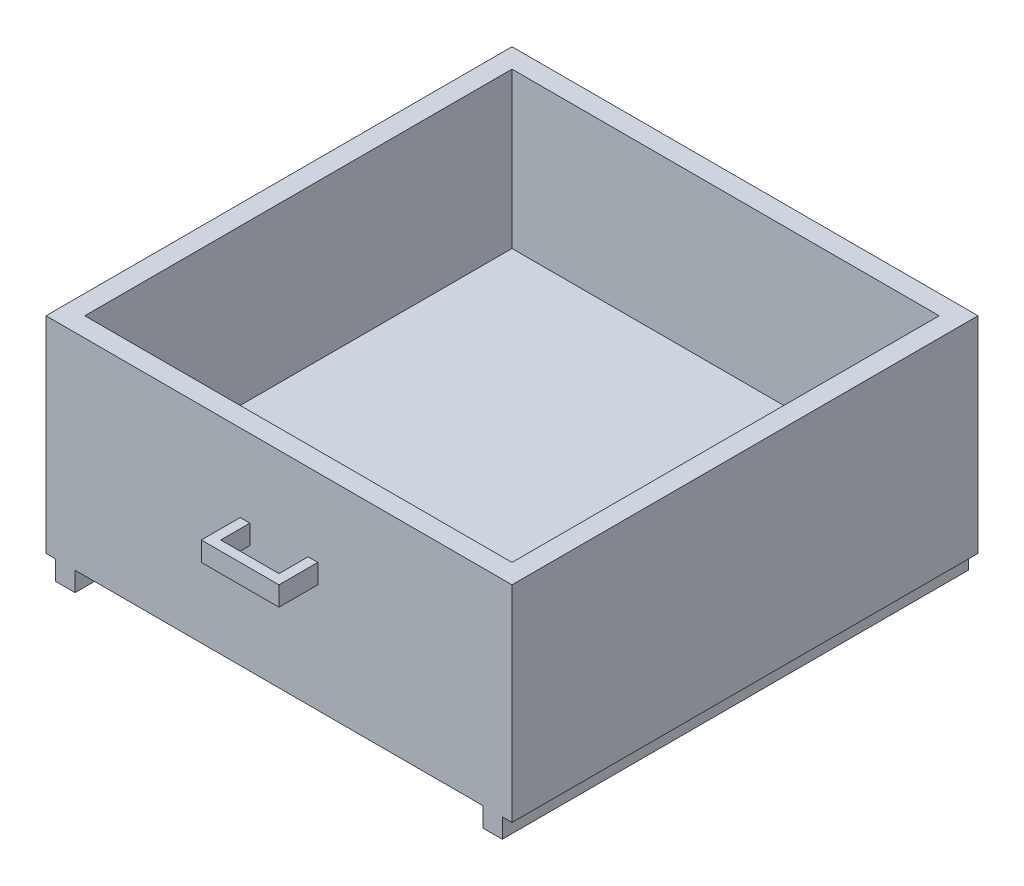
ISO-10303-21;
HEADER;
FILE_DESCRIPTION(('STEP AP214'),'2;1');
FILE_NAME('part.step','',(''),(''),'','','');
FILE_SCHEMA(('AUTOMOTIVE_DESIGN { 1 0 10303 214 1 1 1 1 }'));
ENDSEC;
DATA;
#1=APPLICATION_CONTEXT('core data for automotive mechanical design processes');
#2=APPLICATION_PROTOCOL_DEFINITION('international standard','automotive_design',2000,#1);
#3=PRODUCT_CONTEXT('',#1,'mechanical');
#4=PRODUCT('Part','Part','',(#3));
#5=PRODUCT_RELATED_PRODUCT_CATEGORY('part','',(#4));
#6=PRODUCT_DEFINITION_FORMATION('','',#4);
#7=PRODUCT_DEFINITION_CONTEXT('part definition',#1,'design');
#8=PRODUCT_DEFINITION('design','',#6,#7);
#9=PRODUCT_DEFINITION_SHAPE('','',#8);
#10=(LENGTH_UNIT() NAMED_UNIT(*) SI_UNIT(.MILLI.,.METRE.));
#11=(NAMED_UNIT(*) PLANE_ANGLE_UNIT() SI_UNIT($,.RADIAN.));
#12=(NAMED_UNIT(*) SI_UNIT($,.STERADIAN.) SOLID_ANGLE_UNIT());
#13=UNCERTAINTY_MEASURE_WITH_UNIT(LENGTH_MEASURE(1.E-05),#10,'distance_accuracy_value','');
#14=(GEOMETRIC_REPRESENTATION_CONTEXT(3) GLOBAL_UNCERTAINTY_ASSIGNED_CONTEXT((#13)) GLOBAL_UNIT_ASSIGNED_CONTEXT((#10,
#11,#12)) REPRESENTATION_CONTEXT('',''));
#15=CARTESIAN_POINT('',(0.,0.,0.));
#16=DIRECTION('',(0.,0.,1.));
#17=DIRECTION('',(1.,0.,0.));
#18=AXIS2_PLACEMENT_3D('',#15,#16,#17);
#19=CARTESIAN_POINT('',(-152.4,134.62,152.4));
#20=DIRECTION('',(1.,0.,0.));
#21=DIRECTION('',(0.,1.,0.));
#22=AXIS2_PLACEMENT_3D('',#19,#20,#21);
#23=PLANE('',#22);
#24=DIRECTION('',(0.,-1.,0.));
#25=VECTOR('',#24,1.);
#26=CARTESIAN_POINT('',(-152.4,134.62,-152.4));
#27=LINE('',#26,#25);
#28=CARTESIAN_POINT('',(-152.4,134.62,-152.4));
#29=VERTEX_POINT('',#28);
#30=CARTESIAN_POINT('',(-152.4,0.,-152.4));
#31=VERTEX_POINT('',#30);
#32=EDGE_CURVE('E282',#29,#31,#27,.T.);
#33=ORIENTED_EDGE('',*,*,#32,.T.);
#34=DIRECTION('',(0.,0.,-1.));
#35=VECTOR('',#34,1.);
#36=CARTESIAN_POINT('',(-152.4,0.,152.4));
#37=LINE('',#36,#35);
#38=CARTESIAN_POINT('',(-152.4,0.,152.4));
#39=VERTEX_POINT('',#38);
#40=EDGE_CURVE('E377',#39,#31,#37,.T.);
#41=ORIENTED_EDGE('',*,*,#40,.F.);
#42=DIRECTION('',(0.,-1.,0.));
#43=VECTOR('',#42,1.);
#44=CARTESIAN_POINT('',(-152.4,134.62,152.4));
#45=LINE('',#44,#43);
#46=CARTESIAN_POINT('',(-152.4,134.62,152.4));
#47=VERTEX_POINT('',#46);
#48=EDGE_CURVE('E289',#47,#39,#45,.T.);
#49=ORIENTED_EDGE('',*,*,#48,.F.);
#50=DIRECTION('',(0.,0.,-1.));
#51=VECTOR('',#50,1.);
#52=CARTESIAN_POINT('',(-152.4,134.62,152.4));
#53=LINE('',#52,#51);
#54=EDGE_CURVE('E321',#47,#29,#53,.T.);
#55=ORIENTED_EDGE('',*,*,#54,.T.);
#56=EDGE_LOOP('',(#33,#41,#49,#55));
#57=FACE_BOUND('',#56,.T.);
#58=ADVANCED_FACE('F39',(#57),#23,.F.);
#59=CARTESIAN_POINT('',(-152.4,0.,152.4));
#60=DIRECTION('',(0.,1.,0.));
#61=DIRECTION('',(-1.,0.,0.));
#62=AXIS2_PLACEMENT_3D('',#59,#60,#61);
#63=PLANE('',#62);
#64=DIRECTION('',(1.,0.,0.));
#65=VECTOR('',#64,1.);
#66=CARTESIAN_POINT('',(-152.4,0.,-152.4));
#67=LINE('',#66,#65);
#68=CARTESIAN_POINT('',(-146.05,0.,-152.4));
#69=VERTEX_POINT('',#68);
#70=EDGE_CURVE('E324',#31,#69,#67,.T.);
#71=ORIENTED_EDGE('',*,*,#70,.T.);
#72=DIRECTION('',(0.,0.,-1.));
#73=VECTOR('',#72,1.);
#74=CARTESIAN_POINT('',(-146.05,0.,152.4));
#75=LINE('',#74,#73);
#76=CARTESIAN_POINT('',(-146.05,0.,152.4));
#77=VERTEX_POINT('',#76);
#78=EDGE_CURVE('E374',#77,#69,#75,.T.);
#79=ORIENTED_EDGE('',*,*,#78,.F.);
#80=DIRECTION('',(1.,0.,0.));
#81=VECTOR('',#80,1.);
#82=CARTESIAN_POINT('',(-152.4,0.,152.4));
#83=LINE('',#82,#81);
#84=EDGE_CURVE('E292',#39,#77,#83,.T.);
#85=ORIENTED_EDGE('',*,*,#84,.F.);
#86=ORIENTED_EDGE('',*,*,#40,.T.);
#87=EDGE_LOOP('',(#71,#79,#85,#86));
#88=FACE_BOUND('',#87,.T.);
#89=ADVANCED_FACE('F421',(#88),#63,.F.);
#90=CARTESIAN_POINT('',(-146.05,0.,152.4));
#91=DIRECTION('',(1.,0.,0.));
#92=DIRECTION('',(0.,0.,-1.));
#93=AXIS2_PLACEMENT_3D('',#90,#91,#92);
#94=PLANE('',#93);
#95=DIRECTION('',(0.,-1.,0.));
#96=VECTOR('',#95,1.);
#97=CARTESIAN_POINT('',(-146.05,0.,-152.4));
#98=LINE('',#97,#96);
#99=CARTESIAN_POINT('',(-146.05,-12.7000000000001,-152.4));
#100=VERTEX_POINT('',#99);
#101=EDGE_CURVE('E326',#69,#100,#98,.T.);
#102=ORIENTED_EDGE('',*,*,#101,.T.);
#103=DIRECTION('',(0.,0.,-1.));
#104=VECTOR('',#103,1.);
#105=CARTESIAN_POINT('',(-146.05,-12.7000000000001,152.4));
#106=LINE('',#105,#104);
#107=CARTESIAN_POINT('',(-146.05,-12.7000000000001,152.4));
#108=VERTEX_POINT('',#107);
#109=EDGE_CURVE('E371',#108,#100,#106,.T.);
#110=ORIENTED_EDGE('',*,*,#109,.F.);
#111=DIRECTION('',(0.,-1.,0.));
#112=VECTOR('',#111,1.);
#113=CARTESIAN_POINT('',(-146.05,0.,152.4));
#114=LINE('',#113,#112);
#115=EDGE_CURVE('E295',#77,#108,#114,.T.);
#116=ORIENTED_EDGE('',*,*,#115,.F.);
#117=ORIENTED_EDGE('',*,*,#78,.T.);
#118=EDGE_LOOP('',(#102,#110,#116,#117));
#119=FACE_BOUND('',#118,.T.);
#120=ADVANCED_FACE('F426',(#119),#94,.F.);
#121=CARTESIAN_POINT('',(-146.05,-12.7000000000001,152.4));
#122=DIRECTION('',(0.,1.,0.));
#123=DIRECTION('',(-1.,0.,0.));
#124=AXIS2_PLACEMENT_3D('',#121,#122,#123);
#125=PLANE('',#124);
#126=DIRECTION('',(1.,0.,0.));
#127=VECTOR('',#126,1.);
#128=CARTESIAN_POINT('',(-146.05,-12.7000000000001,-152.4));
#129=LINE('',#128,#127);
#130=CARTESIAN_POINT('',(-133.35,-12.7000000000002,-152.4));
#131=VERTEX_POINT('',#130);
#132=EDGE_CURVE('E328',#100,#131,#129,.T.);
#133=ORIENTED_EDGE('',*,*,#132,.T.);
#134=DIRECTION('',(0.,0.,-1.));
#135=VECTOR('',#134,1.);
#136=CARTESIAN_POINT('',(-133.35,-12.7000000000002,152.4));
#137=LINE('',#136,#135);
#138=CARTESIAN_POINT('',(-133.35,-12.7000000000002,152.4));
#139=VERTEX_POINT('',#138);
#140=EDGE_CURVE('E368',#139,#131,#137,.T.);
#141=ORIENTED_EDGE('',*,*,#140,.F.);
#142=DIRECTION('',(1.,0.,0.));
#143=VECTOR('',#142,1.);
#144=CARTESIAN_POINT('',(-146.05,-12.7000000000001,152.4));
#145=LINE('',#144,#143);
#146=EDGE_CURVE('E297',#108,#139,#145,.T.);
#147=ORIENTED_EDGE('',*,*,#146,.F.);
#148=ORIENTED_EDGE('',*,*,#109,.T.);
#149=EDGE_LOOP('',(#133,#141,#147,#148));
#150=FACE_BOUND('',#149,.T.);
#151=ADVANCED_FACE('F467',(#150),#125,.F.);
#152=CARTESIAN_POINT('',(-133.35,-12.7000000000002,152.4));
#153=DIRECTION('',(-1.,0.,0.));
#154=DIRECTION('',(0.,0.,1.));
#155=AXIS2_PLACEMENT_3D('',#152,#153,#154);
#156=PLANE('',#155);
#157=DIRECTION('',(0.,1.,0.));
#158=VECTOR('',#157,1.);
#159=CARTESIAN_POINT('',(-133.35,-12.7000000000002,-152.4));
#160=LINE('',#159,#158);
#161=CARTESIAN_POINT('',(-133.35,0.,-152.4));
#162=VERTEX_POINT('',#161);
#163=EDGE_CURVE('E330',#131,#162,#160,.T.);
#164=ORIENTED_EDGE('',*,*,#163,.T.);
#165=DIRECTION('',(0.,0.,-1.));
#166=VECTOR('',#165,1.);
#167=CARTESIAN_POINT('',(-133.35,0.,152.4));
#168=LINE('',#167,#166);
#169=CARTESIAN_POINT('',(-133.35,0.,152.4));
#170=VERTEX_POINT('',#169);
#171=EDGE_CURVE('E365',#170,#162,#168,.T.);
#172=ORIENTED_EDGE('',*,*,#171,.F.);
#173=DIRECTION('',(0.,1.,0.));
#174=VECTOR('',#173,1.);
#175=CARTESIAN_POINT('',(-133.35,-12.7000000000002,152.4));
#176=LINE('',#175,#174);
#177=EDGE_CURVE('E299',#139,#170,#176,.T.);
#178=ORIENTED_EDGE('',*,*,#177,.F.);
#179=ORIENTED_EDGE('',*,*,#140,.T.);
#180=EDGE_LOOP('',(#164,#172,#178,#179));
#181=FACE_BOUND('',#180,.T.);
#182=ADVANCED_FACE('F463',(#181),#156,.F.);
#183=CARTESIAN_POINT('',(-133.35,0.,152.4));
#184=DIRECTION('',(0.,1.,0.));
#185=DIRECTION('',(-1.,0.,0.));
#186=AXIS2_PLACEMENT_3D('',#183,#184,#185);
#187=PLANE('',#186);
#188=DIRECTION('',(1.,0.,0.));
#189=VECTOR('',#188,1.);
#190=CARTESIAN_POINT('',(-133.35,0.,-152.4));
#191=LINE('',#190,#189);
#192=CARTESIAN_POINT('',(133.35,1.31838984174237E-13,-152.4));
#193=VERTEX_POINT('',#192);
#194=EDGE_CURVE('E332',#162,#193,#191,.T.);
#195=ORIENTED_EDGE('',*,*,#194,.T.);
#196=DIRECTION('',(0.,0.,-1.));
#197=VECTOR('',#196,1.);
#198=CARTESIAN_POINT('',(133.35,1.31838984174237E-13,152.4));
#199=LINE('',#198,#197);
#200=CARTESIAN_POINT('',(133.35,1.31838984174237E-13,152.4));
#201=VERTEX_POINT('',#200);
#202=EDGE_CURVE('E363',#201,#193,#199,.T.);
#203=ORIENTED_EDGE('',*,*,#202,.F.);
#204=DIRECTION('',(1.,0.,0.));
#205=VECTOR('',#204,1.);
#206=CARTESIAN_POINT('',(-133.35,0.,152.4));
#207=LINE('',#206,#205);
#208=EDGE_CURVE('E301',#170,#201,#207,.T.);
#209=ORIENTED_EDGE('',*,*,#208,.F.);
#210=ORIENTED_EDGE('',*,*,#171,.T.);
#211=EDGE_LOOP('',(#195,#203,#209,#210));
#212=FACE_BOUND('',#211,.T.);
#213=ADVANCED_FACE('F459',(#212),#187,.F.);
#214=CARTESIAN_POINT('',(133.35,-12.7000000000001,152.4));
#215=DIRECTION('',(-1.,0.,0.));
#216=DIRECTION('',(0.,0.,1.));
#217=AXIS2_PLACEMENT_3D('',#214,#215,#216);
#218=PLANE('',#217);
#219=DIRECTION('',(0.,1.,0.));
#220=VECTOR('',#219,1.);
#221=CARTESIAN_POINT('',(133.35,-12.7000000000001,-152.4));
#222=LINE('',#221,#220);
#223=CARTESIAN_POINT('',(133.35,-12.7000000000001,-152.4));
#224=VERTEX_POINT('',#223);
#225=EDGE_CURVE('E335',#224,#193,#222,.T.);
#226=ORIENTED_EDGE('',*,*,#225,.F.);
#227=DIRECTION('',(0.,0.,-1.));
#228=VECTOR('',#227,1.);
#229=CARTESIAN_POINT('',(133.35,-12.7000000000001,152.4));
#230=LINE('',#229,#228);
#231=CARTESIAN_POINT('',(133.35,-12.7000000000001,152.4));
#232=VERTEX_POINT('',#231);
#233=EDGE_CURVE('E361',#232,#224,#230,.T.);
#234=ORIENTED_EDGE('',*,*,#233,.F.);
#235=DIRECTION('',(0.,1.,0.));
#236=VECTOR('',#235,1.);
#237=CARTESIAN_POINT('',(133.35,-12.7000000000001,152.4));
#238=LINE('',#237,#236);
#239=EDGE_CURVE('E303',#232,#201,#238,.T.);
#240=ORIENTED_EDGE('',*,*,#239,.T.);
#241=ORIENTED_EDGE('',*,*,#202,.T.);
#242=EDGE_LOOP('',(#226,#234,#240,#241));
#243=FACE_BOUND('',#242,.T.);
#244=ADVANCED_FACE('F454',(#243),#218,.T.);
#245=CARTESIAN_POINT('',(146.05,-12.7,152.4));
#246=DIRECTION('',(0.,-1.,0.));
#247=DIRECTION('',(1.,0.,0.));
#248=AXIS2_PLACEMENT_3D('',#245,#246,#247);
#249=PLANE('',#248);
#250=DIRECTION('',(-1.,0.,0.));
#251=VECTOR('',#250,1.);
#252=CARTESIAN_POINT('',(146.05,-12.7,-152.4));
#253=LINE('',#252,#251);
#254=CARTESIAN_POINT('',(146.05,-12.7,-152.4));
#255=VERTEX_POINT('',#254);
#256=EDGE_CURVE('E338',#255,#224,#253,.T.);
#257=ORIENTED_EDGE('',*,*,#256,.F.);
#258=DIRECTION('',(0.,0.,-1.));
#259=VECTOR('',#258,1.);
#260=CARTESIAN_POINT('',(146.05,-12.7,152.4));
#261=LINE('',#260,#259);
#262=CARTESIAN_POINT('',(146.05,-12.7,152.4));
#263=VERTEX_POINT('',#262);
#264=EDGE_CURVE('E359',#263,#255,#261,.T.);
#265=ORIENTED_EDGE('',*,*,#264,.F.);
#266=DIRECTION('',(-1.,0.,0.));
#267=VECTOR('',#266,1.);
#268=CARTESIAN_POINT('',(146.05,-12.7,152.4));
#269=LINE('',#268,#267);
#270=EDGE_CURVE('E306',#263,#232,#269,.T.);
#271=ORIENTED_EDGE('',*,*,#270,.T.);
#272=ORIENTED_EDGE('',*,*,#233,.T.);
#273=EDGE_LOOP('',(#257,#265,#271,#272));
#274=FACE_BOUND('',#273,.T.);
#275=ADVANCED_FACE('F449',(#274),#249,.T.);
#276=CARTESIAN_POINT('',(146.05,0.,152.4));
#277=DIRECTION('',(1.,0.,0.));
#278=DIRECTION('',(0.,0.,-1.));
#279=AXIS2_PLACEMENT_3D('',#276,#277,#278);
#280=PLANE('',#279);
#281=DIRECTION('',(0.,-1.,0.));
#282=VECTOR('',#281,1.);
#283=CARTESIAN_POINT('',(146.05,0.,-152.4));
#284=LINE('',#283,#282);
#285=CARTESIAN_POINT('',(146.05,0.,-152.4));
#286=VERTEX_POINT('',#285);
#287=EDGE_CURVE('E341',#286,#255,#284,.T.);
#288=ORIENTED_EDGE('',*,*,#287,.F.);
#289=DIRECTION('',(0.,0.,-1.));
#290=VECTOR('',#289,1.);
#291=CARTESIAN_POINT('',(146.05,0.,152.4));
#292=LINE('',#291,#290);
#293=CARTESIAN_POINT('',(146.05,0.,152.4));
#294=VERTEX_POINT('',#293);
#295=EDGE_CURVE('E357',#294,#286,#292,.T.);
#296=ORIENTED_EDGE('',*,*,#295,.F.);
#297=DIRECTION('',(0.,-1.,0.));
#298=VECTOR('',#297,1.);
#299=CARTESIAN_POINT('',(146.05,0.,152.4));
#300=LINE('',#299,#298);
#301=EDGE_CURVE('E309',#294,#263,#300,.T.);
#302=ORIENTED_EDGE('',*,*,#301,.T.);
#303=ORIENTED_EDGE('',*,*,#264,.T.);
#304=EDGE_LOOP('',(#288,#296,#302,#303));
#305=FACE_BOUND('',#304,.T.);
#306=ADVANCED_FACE('F445',(#305),#280,.T.);
#307=CARTESIAN_POINT('',(152.4,0.,152.4));
#308=DIRECTION('',(0.,-1.,0.));
#309=DIRECTION('',(0.,0.,-1.));
#310=AXIS2_PLACEMENT_3D('',#307,#308,#309);
#311=PLANE('',#310);
#312=DIRECTION('',(-1.,0.,0.));
#313=VECTOR('',#312,1.);
#314=CARTESIAN_POINT('',(152.4,0.,-152.4));
#315=LINE('',#314,#313);
#316=CARTESIAN_POINT('',(152.4,0.,-152.4));
#317=VERTEX_POINT('',#316);
#318=EDGE_CURVE('E344',#317,#286,#315,.T.);
#319=ORIENTED_EDGE('',*,*,#318,.F.);
#320=DIRECTION('',(0.,0.,-1.));
#321=VECTOR('',#320,1.);
#322=CARTESIAN_POINT('',(152.4,0.,152.4));
#323=LINE('',#322,#321);
#324=CARTESIAN_POINT('',(152.4,0.,152.4));
#325=VERTEX_POINT('',#324);
#326=EDGE_CURVE('E355',#325,#317,#323,.T.);
#327=ORIENTED_EDGE('',*,*,#326,.F.);
#328=DIRECTION('',(-1.,0.,0.));
#329=VECTOR('',#328,1.);
#330=CARTESIAN_POINT('',(152.4,0.,152.4));
#331=LINE('',#330,#329);
#332=EDGE_CURVE('E312',#325,#294,#331,.T.);
#333=ORIENTED_EDGE('',*,*,#332,.T.);
#334=ORIENTED_EDGE('',*,*,#295,.T.);
#335=EDGE_LOOP('',(#319,#327,#333,#334));
#336=FACE_BOUND('',#335,.T.);
#337=ADVANCED_FACE('F441',(#336),#311,.T.);
#338=CARTESIAN_POINT('',(152.4,134.62,152.4));
#339=DIRECTION('',(1.,0.,0.));
#340=DIRECTION('',(0.,1.,0.));
#341=AXIS2_PLACEMENT_3D('',#338,#339,#340);
#342=PLANE('',#341);
#343=DIRECTION('',(0.,-1.,0.));
#344=VECTOR('',#343,1.);
#345=CARTESIAN_POINT('',(152.4,134.62,-152.4));
#346=LINE('',#345,#344);
#347=CARTESIAN_POINT('',(152.4,134.62,-152.4));
#348=VERTEX_POINT('',#347);
#349=EDGE_CURVE('E347',#348,#317,#346,.T.);
#350=ORIENTED_EDGE('',*,*,#349,.F.);
#351=DIRECTION('',(0.,0.,-1.));
#352=VECTOR('',#351,1.);
#353=CARTESIAN_POINT('',(152.4,134.62,152.4));
#354=LINE('',#353,#352);
#355=CARTESIAN_POINT('',(152.4,134.62,152.4));
#356=VERTEX_POINT('',#355);
#357=EDGE_CURVE('E353',#356,#348,#354,.T.);
#358=ORIENTED_EDGE('',*,*,#357,.F.);
#359=DIRECTION('',(0.,-1.,0.));
#360=VECTOR('',#359,1.);
#361=CARTESIAN_POINT('',(152.4,134.62,152.4));
#362=LINE('',#361,#360);
#363=EDGE_CURVE('E315',#356,#325,#362,.T.);
#364=ORIENTED_EDGE('',*,*,#363,.T.);
#365=ORIENTED_EDGE('',*,*,#326,.T.);
#366=EDGE_LOOP('',(#350,#358,#364,#365));
#367=FACE_BOUND('',#366,.T.);
#368=ADVANCED_FACE('F416',(#367),#342,.T.);
#369=CARTESIAN_POINT('',(-152.4,134.62,152.4));
#370=DIRECTION('',(0.,1.,0.));
#371=DIRECTION('',(-1.,0.,0.));
#372=AXIS2_PLACEMENT_3D('',#369,#370,#371);
#373=PLANE('',#372);
#374=DIRECTION('',(1.,0.,0.));
#375=VECTOR('',#374,1.);
#376=CARTESIAN_POINT('',(139.7,134.62,139.7));
#377=LINE('',#376,#375);
#378=CARTESIAN_POINT('',(-139.7,134.62,139.7));
#379=VERTEX_POINT('',#378);
#380=CARTESIAN_POINT('',(139.7,134.62,139.7));
#381=VERTEX_POINT('',#380);
#382=EDGE_CURVE('E248',#379,#381,#377,.T.);
#383=ORIENTED_EDGE('',*,*,#382,.F.);
#384=DIRECTION('',(0.,0.,1.));
#385=VECTOR('',#384,1.);
#386=CARTESIAN_POINT('',(-139.7,134.62,139.7));
#387=LINE('',#386,#385);
#388=CARTESIAN_POINT('',(-139.7,134.62,-139.7));
#389=VERTEX_POINT('',#388);
#390=EDGE_CURVE('E261',#389,#379,#387,.T.);
#391=ORIENTED_EDGE('',*,*,#390,.F.);
#392=DIRECTION('',(-1.,0.,0.));
#393=VECTOR('',#392,1.);
#394=CARTESIAN_POINT('',(-139.7,134.62,-139.7));
#395=LINE('',#394,#393);
#396=CARTESIAN_POINT('',(139.7,134.62,-139.7));
#397=VERTEX_POINT('',#396);
#398=EDGE_CURVE('E275',#397,#389,#395,.T.);
#399=ORIENTED_EDGE('',*,*,#398,.F.);
#400=DIRECTION('',(0.,0.,-1.));
#401=VECTOR('',#400,1.);
#402=CARTESIAN_POINT('',(139.7,134.62,-139.7));
#403=LINE('',#402,#401);
#404=EDGE_CURVE('E272',#381,#397,#403,.T.);
#405=ORIENTED_EDGE('',*,*,#404,.F.);
#406=EDGE_LOOP('',(#383,#391,#399,#405));
#407=FACE_BOUND('',#406,.T.);
#408=DIRECTION('',(1.,0.,0.));
#409=VECTOR('',#408,1.);
#410=CARTESIAN_POINT('',(-152.4,134.62,-152.4));
#411=LINE('',#410,#409);
#412=EDGE_CURVE('E293',#29,#348,#411,.T.);
#413=ORIENTED_EDGE('',*,*,#412,.F.);
#414=ORIENTED_EDGE('',*,*,#54,.F.);
#415=DIRECTION('',(1.,0.,0.));
#416=VECTOR('',#415,1.);
#417=CARTESIAN_POINT('',(-152.4,134.62,152.4));
#418=LINE('',#417,#416);
#419=EDGE_CURVE('E318',#47,#356,#418,.T.);
#420=ORIENTED_EDGE('',*,*,#419,.T.);
#421=ORIENTED_EDGE('',*,*,#357,.T.);
#422=EDGE_LOOP('',(#413,#414,#420,#421));
#423=FACE_BOUND('',#422,.T.);
#424=ADVANCED_FACE('F406',(#407,#423),#373,.T.);
#425=CARTESIAN_POINT('',(0.,0.,152.4));
#426=DIRECTION('',(0.,0.,1.));
#427=DIRECTION('',(1.,0.,0.));
#428=AXIS2_PLACEMENT_3D('',#425,#426,#427);
#429=PLANE('',#428);
#430=ORIENTED_EDGE('',*,*,#208,.T.);
#431=ORIENTED_EDGE('',*,*,#239,.F.);
#432=ORIENTED_EDGE('',*,*,#270,.F.);
#433=ORIENTED_EDGE('',*,*,#301,.F.);
#434=ORIENTED_EDGE('',*,*,#332,.F.);
#435=ORIENTED_EDGE('',*,*,#363,.F.);
#436=ORIENTED_EDGE('',*,*,#419,.F.);
#437=ORIENTED_EDGE('',*,*,#48,.T.);
#438=ORIENTED_EDGE('',*,*,#84,.T.);
#439=ORIENTED_EDGE('',*,*,#115,.T.);
#440=ORIENTED_EDGE('',*,*,#146,.T.);
#441=ORIENTED_EDGE('',*,*,#177,.T.);
#442=EDGE_LOOP('',(#430,#431,#432,#433,#434,#435,#436,#437,#438,#439,#440,#441));
#443=FACE_BOUND('',#442,.T.);
#444=DIRECTION('',(-1.,0.,0.));
#445=VECTOR('',#444,1.);
#446=CARTESIAN_POINT('',(25.4,71.12,152.4));
#447=LINE('',#446,#445);
#448=CARTESIAN_POINT('',(25.4,71.12,152.4));
#449=VERTEX_POINT('',#448);
#450=CARTESIAN_POINT('',(19.05,71.12,152.4));
#451=VERTEX_POINT('',#450);
#452=EDGE_CURVE('E238',#449,#451,#447,.T.);
#453=ORIENTED_EDGE('',*,*,#452,.T.);
#454=DIRECTION('',(0.,1.,0.));
#455=VECTOR('',#454,1.);
#456=CARTESIAN_POINT('',(19.05,-12.7000000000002,152.4));
#457=LINE('',#456,#455);
#458=CARTESIAN_POINT('',(19.05,83.82,152.4));
#459=VERTEX_POINT('',#458);
#460=EDGE_CURVE('E204',#451,#459,#457,.T.);
#461=ORIENTED_EDGE('',*,*,#460,.T.);
#462=DIRECTION('',(1.,0.,0.));
#463=VECTOR('',#462,1.);
#464=CARTESIAN_POINT('',(-25.4,83.82,152.4));
#465=LINE('',#464,#463);
#466=CARTESIAN_POINT('',(25.4,83.82,152.4));
#467=VERTEX_POINT('',#466);
#468=EDGE_CURVE('E214',#459,#467,#465,.T.);
#469=ORIENTED_EDGE('',*,*,#468,.T.);
#470=DIRECTION('',(0.,-1.,0.));
#471=VECTOR('',#470,1.);
#472=CARTESIAN_POINT('',(25.4,83.82,152.4));
#473=LINE('',#472,#471);
#474=EDGE_CURVE('E221',#467,#449,#473,.T.);
#475=ORIENTED_EDGE('',*,*,#474,.T.);
#476=EDGE_LOOP('',(#453,#461,#469,#475));
#477=FACE_BOUND('',#476,.T.);
#478=DIRECTION('',(0.,1.,0.));
#479=VECTOR('',#478,1.);
#480=CARTESIAN_POINT('',(-19.05,-12.7000000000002,152.4));
#481=LINE('',#480,#479);
#482=CARTESIAN_POINT('',(-19.05,71.12,152.4));
#483=VERTEX_POINT('',#482);
#484=CARTESIAN_POINT('',(-19.05,83.82,152.4));
#485=VERTEX_POINT('',#484);
#486=EDGE_CURVE('E219',#483,#485,#481,.T.);
#487=ORIENTED_EDGE('',*,*,#486,.F.);
#488=CARTESIAN_POINT('',(-25.4,71.12,152.4));
#489=VERTEX_POINT('',#488);
#490=EDGE_CURVE('E237',#483,#489,#447,.T.);
#491=ORIENTED_EDGE('',*,*,#490,.T.);
#492=DIRECTION('',(0.,-1.,0.));
#493=VECTOR('',#492,1.);
#494=CARTESIAN_POINT('',(-25.4,83.82,152.4));
#495=LINE('',#494,#493);
#496=CARTESIAN_POINT('',(-25.4,83.82,152.4));
#497=VERTEX_POINT('',#496);
#498=EDGE_CURVE('E241',#497,#489,#495,.T.);
#499=ORIENTED_EDGE('',*,*,#498,.F.);
#500=EDGE_CURVE('E227',#497,#485,#465,.T.);
#501=ORIENTED_EDGE('',*,*,#500,.T.);
#502=EDGE_LOOP('',(#487,#491,#499,#501));
#503=FACE_BOUND('',#502,.T.);
#504=ADVANCED_FACE('F389',(#443,#477,#503),#429,.T.);
#505=CARTESIAN_POINT('',(0.,0.,-152.4));
#506=DIRECTION('',(0.,0.,1.));
#507=DIRECTION('',(1.,0.,0.));
#508=AXIS2_PLACEMENT_3D('',#505,#506,#507);
#509=PLANE('',#508);
#510=ORIENTED_EDGE('',*,*,#32,.F.);
#511=ORIENTED_EDGE('',*,*,#412,.T.);
#512=ORIENTED_EDGE('',*,*,#349,.T.);
#513=ORIENTED_EDGE('',*,*,#318,.T.);
#514=ORIENTED_EDGE('',*,*,#287,.T.);
#515=ORIENTED_EDGE('',*,*,#256,.T.);
#516=ORIENTED_EDGE('',*,*,#225,.T.);
#517=ORIENTED_EDGE('',*,*,#194,.F.);
#518=ORIENTED_EDGE('',*,*,#163,.F.);
#519=ORIENTED_EDGE('',*,*,#132,.F.);
#520=ORIENTED_EDGE('',*,*,#101,.F.);
#521=ORIENTED_EDGE('',*,*,#70,.F.);
#522=EDGE_LOOP('',(#510,#511,#512,#513,#514,#515,#516,#517,#518,#519,#520,#521));
#523=FACE_BOUND('',#522,.T.);
#524=ADVANCED_FACE('F405',(#523),#509,.F.);
#525=CARTESIAN_POINT('',(139.7,33.02,139.7));
#526=DIRECTION('',(0.,0.,1.));
#527=DIRECTION('',(1.,0.,0.));
#528=AXIS2_PLACEMENT_3D('',#525,#526,#527);
#529=PLANE('',#528);
#530=ORIENTED_EDGE('',*,*,#382,.T.);
#531=DIRECTION('',(0.,1.,0.));
#532=VECTOR('',#531,1.);
#533=CARTESIAN_POINT('',(139.7,33.02,139.7));
#534=LINE('',#533,#532);
#535=CARTESIAN_POINT('',(139.7,33.02,139.7));
#536=VERTEX_POINT('',#535);
#537=EDGE_CURVE('E270',#536,#381,#534,.T.);
#538=ORIENTED_EDGE('',*,*,#537,.F.);
#539=DIRECTION('',(1.,0.,0.));
#540=VECTOR('',#539,1.);
#541=CARTESIAN_POINT('',(139.7,33.02,139.7));
#542=LINE('',#541,#540);
#543=CARTESIAN_POINT('',(-139.7,33.02,139.7));
#544=VERTEX_POINT('',#543);
#545=EDGE_CURVE('E257',#544,#536,#542,.T.);
#546=ORIENTED_EDGE('',*,*,#545,.F.);
#547=DIRECTION('',(0.,1.,0.));
#548=VECTOR('',#547,1.);
#549=CARTESIAN_POINT('',(-139.7,33.02,139.7));
#550=LINE('',#549,#548);
#551=EDGE_CURVE('E280',#544,#379,#550,.T.);
#552=ORIENTED_EDGE('',*,*,#551,.T.);
#553=EDGE_LOOP('',(#530,#538,#546,#552));
#554=FACE_BOUND('',#553,.T.);
#555=ADVANCED_FACE('F413',(#554),#529,.F.);
#556=CARTESIAN_POINT('',(-139.7,33.02,139.7));
#557=DIRECTION('',(-1.,0.,0.));
#558=DIRECTION('',(0.,0.,1.));
#559=AXIS2_PLACEMENT_3D('',#556,#557,#558);
#560=PLANE('',#559);
#561=ORIENTED_EDGE('',*,*,#390,.T.);
#562=ORIENTED_EDGE('',*,*,#551,.F.);
#563=DIRECTION('',(0.,0.,1.));
#564=VECTOR('',#563,1.);
#565=CARTESIAN_POINT('',(-139.7,33.02,139.7));
#566=LINE('',#565,#564);
#567=CARTESIAN_POINT('',(-139.7,33.02,-139.7));
#568=VERTEX_POINT('',#567);
#569=EDGE_CURVE('E267',#568,#544,#566,.T.);
#570=ORIENTED_EDGE('',*,*,#569,.F.);
#571=DIRECTION('',(0.,1.,0.));
#572=VECTOR('',#571,1.);
#573=CARTESIAN_POINT('',(-139.7,33.02,-139.7));
#574=LINE('',#573,#572);
#575=EDGE_CURVE('E283',#568,#389,#574,.T.);
#576=ORIENTED_EDGE('',*,*,#575,.T.);
#577=EDGE_LOOP('',(#561,#562,#570,#576));
#578=FACE_BOUND('',#577,.T.);
#579=ADVANCED_FACE('F523',(#578),#560,.F.);
#580=CARTESIAN_POINT('',(-139.7,33.02,-139.7));
#581=DIRECTION('',(0.,0.,-1.));
#582=DIRECTION('',(-1.,0.,0.));
#583=AXIS2_PLACEMENT_3D('',#580,#581,#582);
#584=PLANE('',#583);
#585=ORIENTED_EDGE('',*,*,#398,.T.);
#586=ORIENTED_EDGE('',*,*,#575,.F.);
#587=DIRECTION('',(-1.,0.,0.));
#588=VECTOR('',#587,1.);
#589=CARTESIAN_POINT('',(-139.7,33.02,-139.7));
#590=LINE('',#589,#588);
#591=CARTESIAN_POINT('',(139.7,33.02,-139.7));
#592=VERTEX_POINT('',#591);
#593=EDGE_CURVE('E264',#592,#568,#590,.T.);
#594=ORIENTED_EDGE('',*,*,#593,.F.);
#595=DIRECTION('',(0.,1.,0.));
#596=VECTOR('',#595,1.);
#597=CARTESIAN_POINT('',(139.7,33.02,-139.7));
#598=LINE('',#597,#596);
#599=EDGE_CURVE('E285',#592,#397,#598,.T.);
#600=ORIENTED_EDGE('',*,*,#599,.T.);
#601=EDGE_LOOP('',(#585,#586,#594,#600));
#602=FACE_BOUND('',#601,.T.);
#603=ADVANCED_FACE('F532',(#602),#584,.F.);
#604=CARTESIAN_POINT('',(139.7,33.02,-139.7));
#605=DIRECTION('',(1.,0.,0.));
#606=DIRECTION('',(0.,0.,-1.));
#607=AXIS2_PLACEMENT_3D('',#604,#605,#606);
#608=PLANE('',#607);
#609=ORIENTED_EDGE('',*,*,#404,.T.);
#610=ORIENTED_EDGE('',*,*,#599,.F.);
#611=DIRECTION('',(0.,0.,-1.));
#612=VECTOR('',#611,1.);
#613=CARTESIAN_POINT('',(139.7,33.02,-139.7));
#614=LINE('',#613,#612);
#615=EDGE_CURVE('E260',#536,#592,#614,.T.);
#616=ORIENTED_EDGE('',*,*,#615,.F.);
#617=ORIENTED_EDGE('',*,*,#537,.T.);
#618=EDGE_LOOP('',(#609,#610,#616,#617));
#619=FACE_BOUND('',#618,.T.);
#620=ADVANCED_FACE('F542',(#619),#608,.F.);
#621=CARTESIAN_POINT('',(0.,33.02,0.));
#622=DIRECTION('',(0.,-1.,0.));
#623=DIRECTION('',(0.,0.,-1.));
#624=AXIS2_PLACEMENT_3D('',#621,#622,#623);
#625=PLANE('',#624);
#626=ORIENTED_EDGE('',*,*,#545,.T.);
#627=ORIENTED_EDGE('',*,*,#615,.T.);
#628=ORIENTED_EDGE('',*,*,#593,.T.);
#629=ORIENTED_EDGE('',*,*,#569,.T.);
#630=EDGE_LOOP('',(#626,#627,#628,#629));
#631=FACE_BOUND('',#630,.T.);
#632=ADVANCED_FACE('F552',(#631),#625,.F.);
#633=CARTESIAN_POINT('',(25.4,83.82,177.8));
#634=DIRECTION('',(1.,0.,0.));
#635=DIRECTION('',(0.,1.,0.));
#636=AXIS2_PLACEMENT_3D('',#633,#634,#635);
#637=PLANE('',#636);
#638=ORIENTED_EDGE('',*,*,#474,.F.);
#639=DIRECTION('',(0.,0.,-1.));
#640=VECTOR('',#639,1.);
#641=CARTESIAN_POINT('',(25.4,83.82,177.8));
#642=LINE('',#641,#640);
#643=CARTESIAN_POINT('',(25.4,83.82,177.8));
#644=VERTEX_POINT('',#643);
#645=EDGE_CURVE('E246',#644,#467,#642,.T.);
#646=ORIENTED_EDGE('',*,*,#645,.F.);
#647=DIRECTION('',(0.,-1.,0.));
#648=VECTOR('',#647,1.);
#649=CARTESIAN_POINT('',(25.4,83.82,177.8));
#650=LINE('',#649,#648);
#651=CARTESIAN_POINT('',(25.4,71.12,177.8));
#652=VERTEX_POINT('',#651);
#653=EDGE_CURVE('E223',#644,#652,#650,.T.);
#654=ORIENTED_EDGE('',*,*,#653,.T.);
#655=DIRECTION('',(0.,0.,-1.));
#656=VECTOR('',#655,1.);
#657=CARTESIAN_POINT('',(25.4,71.12,177.8));
#658=LINE('',#657,#656);
#659=EDGE_CURVE('E235',#652,#449,#658,.T.);
#660=ORIENTED_EDGE('',*,*,#659,.T.);
#661=EDGE_LOOP('',(#638,#646,#654,#660));
#662=FACE_BOUND('',#661,.T.);
#663=ADVANCED_FACE('F401',(#662),#637,.T.);
#664=CARTESIAN_POINT('',(-25.4,83.82,177.8));
#665=DIRECTION('',(0.,1.,0.));
#666=DIRECTION('',(0.,0.,1.));
#667=AXIS2_PLACEMENT_3D('',#664,#665,#666);
#668=PLANE('',#667);
#669=DIRECTION('',(0.,0.,1.));
#670=VECTOR('',#669,1.);
#671=CARTESIAN_POINT('',(-19.05,83.82,171.45));
#672=LINE('',#671,#670);
#673=CARTESIAN_POINT('',(-19.05,83.82,171.45));
#674=VERTEX_POINT('',#673);
#675=EDGE_CURVE('E53',#485,#674,#672,.T.);
#676=ORIENTED_EDGE('',*,*,#675,.F.);
#677=ORIENTED_EDGE('',*,*,#500,.F.);
#678=DIRECTION('',(0.,0.,-1.));
#679=VECTOR('',#678,1.);
#680=CARTESIAN_POINT('',(-25.4,83.82,177.8));
#681=LINE('',#680,#679);
#682=CARTESIAN_POINT('',(-25.4,83.82,177.8));
#683=VERTEX_POINT('',#682);
#684=EDGE_CURVE('E249',#683,#497,#681,.T.);
#685=ORIENTED_EDGE('',*,*,#684,.F.);
#686=DIRECTION('',(1.,0.,0.));
#687=VECTOR('',#686,1.);
#688=CARTESIAN_POINT('',(-25.4,83.82,177.8));
#689=LINE('',#688,#687);
#690=EDGE_CURVE('E232',#683,#644,#689,.T.);
#691=ORIENTED_EDGE('',*,*,#690,.T.);
#692=ORIENTED_EDGE('',*,*,#645,.T.);
#693=ORIENTED_EDGE('',*,*,#468,.F.);
#694=DIRECTION('',(0.,0.,-1.));
#695=VECTOR('',#694,1.);
#696=CARTESIAN_POINT('',(19.05,83.82,171.45));
#697=LINE('',#696,#695);
#698=CARTESIAN_POINT('',(19.05,83.82,171.45));
#699=VERTEX_POINT('',#698);
#700=EDGE_CURVE('E200',#699,#459,#697,.T.);
#701=ORIENTED_EDGE('',*,*,#700,.F.);
#702=DIRECTION('',(1.,0.,0.));
#703=VECTOR('',#702,1.);
#704=CARTESIAN_POINT('',(-19.05,83.82,171.45));
#705=LINE('',#704,#703);
#706=EDGE_CURVE('E208',#674,#699,#705,.T.);
#707=ORIENTED_EDGE('',*,*,#706,.F.);
#708=EDGE_LOOP('',(#676,#677,#685,#691,#692,#693,#701,#707));
#709=FACE_BOUND('',#708,.T.);
#710=ADVANCED_FACE('F212',(#709),#668,.T.);
#711=CARTESIAN_POINT('',(-25.4,83.82,177.8));
#712=DIRECTION('',(1.,0.,0.));
#713=DIRECTION('',(0.,0.,-1.));
#714=AXIS2_PLACEMENT_3D('',#711,#712,#713);
#715=PLANE('',#714);
#716=ORIENTED_EDGE('',*,*,#498,.T.);
#717=DIRECTION('',(0.,0.,-1.));
#718=VECTOR('',#717,1.);
#719=CARTESIAN_POINT('',(-25.4,71.12,177.8));
#720=LINE('',#719,#718);
#721=CARTESIAN_POINT('',(-25.4,71.12,177.8));
#722=VERTEX_POINT('',#721);
#723=EDGE_CURVE('E252',#722,#489,#720,.T.);
#724=ORIENTED_EDGE('',*,*,#723,.F.);
#725=DIRECTION('',(0.,-1.,0.));
#726=VECTOR('',#725,1.);
#727=CARTESIAN_POINT('',(-25.4,83.82,177.8));
#728=LINE('',#727,#726);
#729=EDGE_CURVE('E230',#683,#722,#728,.T.);
#730=ORIENTED_EDGE('',*,*,#729,.F.);
#731=ORIENTED_EDGE('',*,*,#684,.T.);
#732=EDGE_LOOP('',(#716,#724,#730,#731));
#733=FACE_BOUND('',#732,.T.);
#734=ADVANCED_FACE('F394',(#733),#715,.F.);
#735=CARTESIAN_POINT('',(25.4,71.12,177.8));
#736=DIRECTION('',(0.,-1.,0.));
#737=DIRECTION('',(0.,0.,-1.));
#738=AXIS2_PLACEMENT_3D('',#735,#736,#737);
#739=PLANE('',#738);
#740=DIRECTION('',(0.,0.,-1.));
#741=VECTOR('',#740,1.);
#742=CARTESIAN_POINT('',(-19.05,71.12,177.8));
#743=LINE('',#742,#741);
#744=CARTESIAN_POINT('',(-19.05,71.12,171.45));
#745=VERTEX_POINT('',#744);
#746=EDGE_CURVE('E11',#745,#483,#743,.T.);
#747=ORIENTED_EDGE('',*,*,#746,.F.);
#748=DIRECTION('',(-1.,0.,0.));
#749=VECTOR('',#748,1.);
#750=CARTESIAN_POINT('',(25.4,71.12,171.45));
#751=LINE('',#750,#749);
#752=CARTESIAN_POINT('',(19.05,71.12,171.45));
#753=VERTEX_POINT('',#752);
#754=EDGE_CURVE('E380',#753,#745,#751,.T.);
#755=ORIENTED_EDGE('',*,*,#754,.F.);
#756=DIRECTION('',(0.,0.,1.));
#757=VECTOR('',#756,1.);
#758=CARTESIAN_POINT('',(19.05,71.12,177.8));
#759=LINE('',#758,#757);
#760=EDGE_CURVE('E46',#451,#753,#759,.T.);
#761=ORIENTED_EDGE('',*,*,#760,.F.);
#762=ORIENTED_EDGE('',*,*,#452,.F.);
#763=ORIENTED_EDGE('',*,*,#659,.F.);
#764=DIRECTION('',(-1.,0.,0.));
#765=VECTOR('',#764,1.);
#766=CARTESIAN_POINT('',(25.4,71.12,177.8));
#767=LINE('',#766,#765);
#768=EDGE_CURVE('E226',#652,#722,#767,.T.);
#769=ORIENTED_EDGE('',*,*,#768,.T.);
#770=ORIENTED_EDGE('',*,*,#723,.T.);
#771=ORIENTED_EDGE('',*,*,#490,.F.);
#772=EDGE_LOOP('',(#747,#755,#761,#762,#763,#769,#770,#771));
#773=FACE_BOUND('',#772,.T.);
#774=ADVANCED_FACE('F386',(#773),#739,.T.);
#775=CARTESIAN_POINT('',(0.,0.,177.8));
#776=DIRECTION('',(0.,0.,-1.));
#777=DIRECTION('',(-1.,0.,0.));
#778=AXIS2_PLACEMENT_3D('',#775,#776,#777);
#779=PLANE('',#778);
#780=ORIENTED_EDGE('',*,*,#653,.F.);
#781=ORIENTED_EDGE('',*,*,#690,.F.);
#782=ORIENTED_EDGE('',*,*,#729,.T.);
#783=ORIENTED_EDGE('',*,*,#768,.F.);
#784=EDGE_LOOP('',(#780,#781,#782,#783));
#785=FACE_BOUND('',#784,.T.);
#786=ADVANCED_FACE('F398',(#785),#779,.F.);
#787=CARTESIAN_POINT('',(-19.05,-12.7000000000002,171.45));
#788=DIRECTION('',(-1.,0.,0.));
#789=DIRECTION('',(0.,0.,1.));
#790=AXIS2_PLACEMENT_3D('',#787,#788,#789);
#791=PLANE('',#790);
#792=ORIENTED_EDGE('',*,*,#746,.T.);
#793=ORIENTED_EDGE('',*,*,#486,.T.);
#794=ORIENTED_EDGE('',*,*,#675,.T.);
#795=DIRECTION('',(0.,1.,0.));
#796=VECTOR('',#795,1.);
#797=CARTESIAN_POINT('',(-19.05,-12.7000000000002,171.45));
#798=LINE('',#797,#796);
#799=EDGE_CURVE('E205',#745,#674,#798,.T.);
#800=ORIENTED_EDGE('',*,*,#799,.F.);
#801=EDGE_LOOP('',(#792,#793,#794,#800));
#802=FACE_BOUND('',#801,.T.);
#803=ADVANCED_FACE('F383',(#802),#791,.F.);
#804=CARTESIAN_POINT('',(19.05,-12.7000000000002,171.45));
#805=DIRECTION('',(1.,0.,0.));
#806=DIRECTION('',(0.,0.,-1.));
#807=AXIS2_PLACEMENT_3D('',#804,#805,#806);
#808=PLANE('',#807);
#809=ORIENTED_EDGE('',*,*,#760,.T.);
#810=DIRECTION('',(0.,1.,0.));
#811=VECTOR('',#810,1.);
#812=CARTESIAN_POINT('',(19.05,-12.7000000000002,171.45));
#813=LINE('',#812,#811);
#814=EDGE_CURVE('E61',#753,#699,#813,.T.);
#815=ORIENTED_EDGE('',*,*,#814,.T.);
#816=ORIENTED_EDGE('',*,*,#700,.T.);
#817=ORIENTED_EDGE('',*,*,#460,.F.);
#818=EDGE_LOOP('',(#809,#815,#816,#817));
#819=FACE_BOUND('',#818,.T.);
#820=ADVANCED_FACE('F198',(#819),#808,.F.);
#821=CARTESIAN_POINT('',(-19.05,-12.7000000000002,171.45));
#822=DIRECTION('',(0.,0.,1.));
#823=DIRECTION('',(1.,0.,0.));
#824=AXIS2_PLACEMENT_3D('',#821,#822,#823);
#825=PLANE('',#824);
#826=ORIENTED_EDGE('',*,*,#754,.T.);
#827=ORIENTED_EDGE('',*,*,#799,.T.);
#828=ORIENTED_EDGE('',*,*,#706,.T.);
#829=ORIENTED_EDGE('',*,*,#814,.F.);
#830=EDGE_LOOP('',(#826,#827,#828,#829));
#831=FACE_BOUND('',#830,.T.);
#832=ADVANCED_FACE('F209',(#831),#825,.F.);
#833=CLOSED_SHELL('',(#58,#89,#120,#151,#182,#213,#244,#275,#306,#337,#368,#424,#504,#524,#555,
#579,#603,#620,#632,#663,#710,#734,#774,#786,#803,#820,#832));
#834=MANIFOLD_SOLID_BREP('B2',#833);
#835=ADVANCED_BREP_SHAPE_REPRESENTATION('',(#18,#834),#14);
#836=SHAPE_DEFINITION_REPRESENTATION(#9,#835);
ENDSEC;
END-ISO-10303-21;
